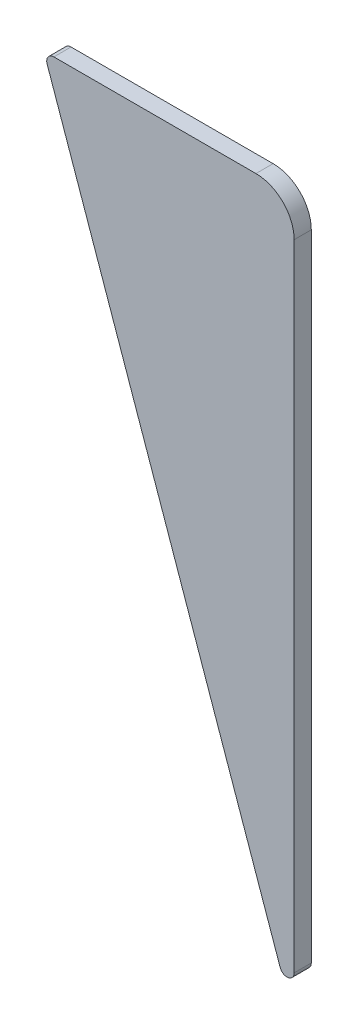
from build123d import *

# Parameters (mm, degrees)
BOSS_EXTRUDE1_DEPTH = 3.048
FILLET1_R           = 6.7818
FILLET2_R           = 1.27


with BuildPart() as part:
    # Sketch1 → Boss-Extrude1 (new body)
    with BuildSketch(Plane.XY):
        Polygon((0, 0), (-44.45, 0), (0, -127), align=None)
    extrude(amount=BOSS_EXTRUDE1_DEPTH)

    # Fillet1
    fillet1_edges = [part.edges().sort_by_distance(p)[0] for p in [
        (0, 0, 1.524),
    ]]
    fillet(fillet1_edges, radius=FILLET1_R)

    # Fillet2
    fillet2_edges = [part.edges().sort_by_distance(p)[0] for p in [
        (0, -127, 1.524),
        (-44.45, 0, 1.524),
    ]]
    fillet(fillet2_edges, radius=FILLET2_R)


solid = part.part
